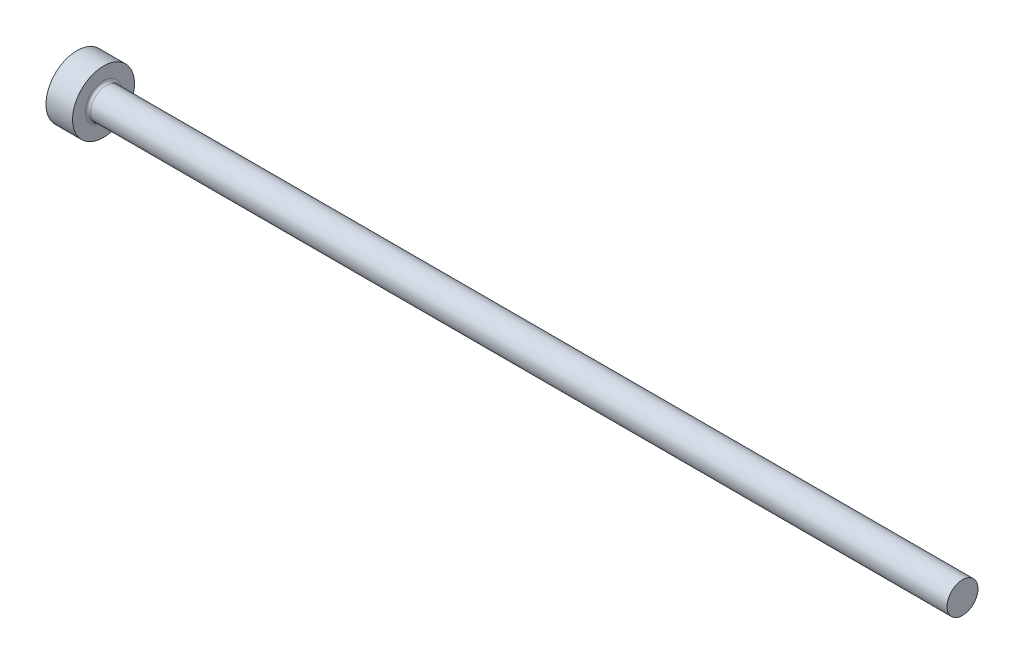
ISO-10303-21;
HEADER;
FILE_DESCRIPTION(('STEP AP214'),'2;1');
FILE_NAME('part.step','',(''),(''),'','','');
FILE_SCHEMA(('AUTOMOTIVE_DESIGN { 1 0 10303 214 1 1 1 1 }'));
ENDSEC;
DATA;
#1=APPLICATION_CONTEXT('core data for automotive mechanical design processes');
#2=APPLICATION_PROTOCOL_DEFINITION('international standard','automotive_design',2000,#1);
#3=PRODUCT_CONTEXT('',#1,'mechanical');
#4=PRODUCT('Part','Part','',(#3));
#5=PRODUCT_RELATED_PRODUCT_CATEGORY('part','',(#4));
#6=PRODUCT_DEFINITION_FORMATION('','',#4);
#7=PRODUCT_DEFINITION_CONTEXT('part definition',#1,'design');
#8=PRODUCT_DEFINITION('design','',#6,#7);
#9=PRODUCT_DEFINITION_SHAPE('','',#8);
#10=(LENGTH_UNIT() NAMED_UNIT(*) SI_UNIT(.MILLI.,.METRE.));
#11=(NAMED_UNIT(*) PLANE_ANGLE_UNIT() SI_UNIT($,.RADIAN.));
#12=(NAMED_UNIT(*) SI_UNIT($,.STERADIAN.) SOLID_ANGLE_UNIT());
#13=UNCERTAINTY_MEASURE_WITH_UNIT(LENGTH_MEASURE(1.E-05),#10,'distance_accuracy_value','');
#14=(GEOMETRIC_REPRESENTATION_CONTEXT(3) GLOBAL_UNCERTAINTY_ASSIGNED_CONTEXT((#13)) GLOBAL_UNIT_ASSIGNED_CONTEXT((#10,
#11,#12)) REPRESENTATION_CONTEXT('',''));
#15=CARTESIAN_POINT('',(0.,0.,0.));
#16=DIRECTION('',(0.,0.,1.));
#17=DIRECTION('',(1.,0.,0.));
#18=AXIS2_PLACEMENT_3D('',#15,#16,#17);
#19=CARTESIAN_POINT('',(0.,0.,0.));
#20=DIRECTION('',(-1.,0.,0.));
#21=DIRECTION('',(0.,-1.,0.));
#22=AXIS2_PLACEMENT_3D('',#19,#20,#21);
#23=PLANE('',#22);
#24=CARTESIAN_POINT('',(0.,0.,0.));
#25=DIRECTION('',(1.,0.,0.));
#26=DIRECTION('',(0.,1.,0.));
#27=AXIS2_PLACEMENT_3D('',#24,#25,#26);
#28=CIRCLE('',#27,3.5);
#29=CARTESIAN_POINT('',(0.,3.5,0.));
#30=VERTEX_POINT('',#29);
#31=EDGE_CURVE('E25',#30,#30,#28,.T.);
#32=ORIENTED_EDGE('',*,*,#31,.F.);
#33=EDGE_LOOP('',(#32));
#34=FACE_BOUND('',#33,.T.);
#35=ADVANCED_FACE('F14',(#34),#23,.T.);
#36=CARTESIAN_POINT('',(100.,0.,0.));
#37=DIRECTION('',(1.,0.,0.));
#38=DIRECTION('',(0.,1.,0.));
#39=AXIS2_PLACEMENT_3D('',#36,#37,#38);
#40=CYLINDRICAL_SURFACE('',#39,3.5);
#41=ORIENTED_EDGE('',*,*,#31,.T.);
#42=EDGE_LOOP('',(#41));
#43=FACE_BOUND('',#42,.T.);
#44=CARTESIAN_POINT('',(3.,0.,0.));
#45=DIRECTION('',(1.,0.,0.));
#46=DIRECTION('',(0.,1.,0.));
#47=AXIS2_PLACEMENT_3D('',#44,#45,#46);
#48=CIRCLE('',#47,3.5);
#49=CARTESIAN_POINT('',(3.,3.5,0.));
#50=VERTEX_POINT('',#49);
#51=EDGE_CURVE('E29',#50,#50,#48,.T.);
#52=ORIENTED_EDGE('',*,*,#51,.F.);
#53=EDGE_LOOP('',(#52));
#54=FACE_BOUND('',#53,.T.);
#55=ADVANCED_FACE('F51',(#43,#54),#40,.T.);
#56=CARTESIAN_POINT('',(3.,3.5,0.));
#57=DIRECTION('',(1.,0.,0.));
#58=DIRECTION('',(0.,1.,0.));
#59=AXIS2_PLACEMENT_3D('',#56,#57,#58);
#60=PLANE('',#59);
#61=CARTESIAN_POINT('',(3.,0.,0.));
#62=DIRECTION('',(1.,0.,0.));
#63=DIRECTION('',(0.,1.,0.));
#64=AXIS2_PLACEMENT_3D('',#61,#62,#63);
#65=CIRCLE('',#64,2.04999999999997);
#66=CARTESIAN_POINT('',(3.,2.04999999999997,0.));
#67=VERTEX_POINT('',#66);
#68=EDGE_CURVE('E9',#67,#67,#65,.F.);
#69=ORIENTED_EDGE('',*,*,#68,.T.);
#70=EDGE_LOOP('',(#69));
#71=FACE_BOUND('',#70,.T.);
#72=ORIENTED_EDGE('',*,*,#51,.T.);
#73=EDGE_LOOP('',(#72));
#74=FACE_BOUND('',#73,.T.);
#75=ADVANCED_FACE('F42',(#71,#74),#60,.T.);
#76=CARTESIAN_POINT('',(100.,0.,0.));
#77=DIRECTION('',(1.,0.,0.));
#78=DIRECTION('',(0.,1.,0.));
#79=AXIS2_PLACEMENT_3D('',#76,#77,#78);
#80=CYLINDRICAL_SURFACE('',#79,1.74999999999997);
#81=CARTESIAN_POINT('',(3.3,0.,0.));
#82=DIRECTION('',(1.,0.,0.));
#83=DIRECTION('',(0.,1.,0.));
#84=AXIS2_PLACEMENT_3D('',#81,#82,#83);
#85=CIRCLE('',#84,1.74999999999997);
#86=CARTESIAN_POINT('',(3.3,1.74999999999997,0.));
#87=VERTEX_POINT('',#86);
#88=EDGE_CURVE('E21',#87,#87,#85,.T.);
#89=ORIENTED_EDGE('',*,*,#88,.T.);
#90=EDGE_LOOP('',(#89));
#91=FACE_BOUND('',#90,.T.);
#92=CARTESIAN_POINT('',(100.,0.,0.));
#93=DIRECTION('',(1.,0.,0.));
#94=DIRECTION('',(0.,1.,0.));
#95=AXIS2_PLACEMENT_3D('',#92,#93,#94);
#96=CIRCLE('',#95,1.75);
#97=CARTESIAN_POINT('',(100.,1.74999999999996,0.));
#98=VERTEX_POINT('',#97);
#99=EDGE_CURVE('E34',#98,#98,#96,.T.);
#100=ORIENTED_EDGE('',*,*,#99,.F.);
#101=EDGE_LOOP('',(#100));
#102=FACE_BOUND('',#101,.T.);
#103=ADVANCED_FACE('F40',(#91,#102),#80,.T.);
#104=CARTESIAN_POINT('',(100.,1.74999999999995,0.));
#105=DIRECTION('',(1.,0.,0.));
#106=DIRECTION('',(0.,1.,0.));
#107=AXIS2_PLACEMENT_3D('',#104,#105,#106);
#108=PLANE('',#107);
#109=ORIENTED_EDGE('',*,*,#99,.T.);
#110=EDGE_LOOP('',(#109));
#111=FACE_BOUND('',#110,.T.);
#112=ADVANCED_FACE('F38',(#111),#108,.T.);
#113=CARTESIAN_POINT('',(3.3,0.,0.));
#114=DIRECTION('',(1.,0.,0.));
#115=DIRECTION('',(0.,1.,0.));
#116=AXIS2_PLACEMENT_3D('',#113,#114,#115);
#117=TOROIDAL_SURFACE('',#116,2.04999999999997,0.3);
#118=ORIENTED_EDGE('',*,*,#68,.F.);
#119=EDGE_LOOP('',(#118));
#120=FACE_BOUND('',#119,.T.);
#121=ORIENTED_EDGE('',*,*,#88,.F.);
#122=EDGE_LOOP('',(#121));
#123=FACE_BOUND('',#122,.T.);
#124=ADVANCED_FACE('F16',(#120,#123),#117,.F.);
#125=CLOSED_SHELL('',(#35,#55,#75,#103,#112,#124));
#126=MANIFOLD_SOLID_BREP('B1',#125);
#127=ADVANCED_BREP_SHAPE_REPRESENTATION('',(#18,#126),#14);
#128=SHAPE_DEFINITION_REPRESENTATION(#9,#127);
ENDSEC;
END-ISO-10303-21;
